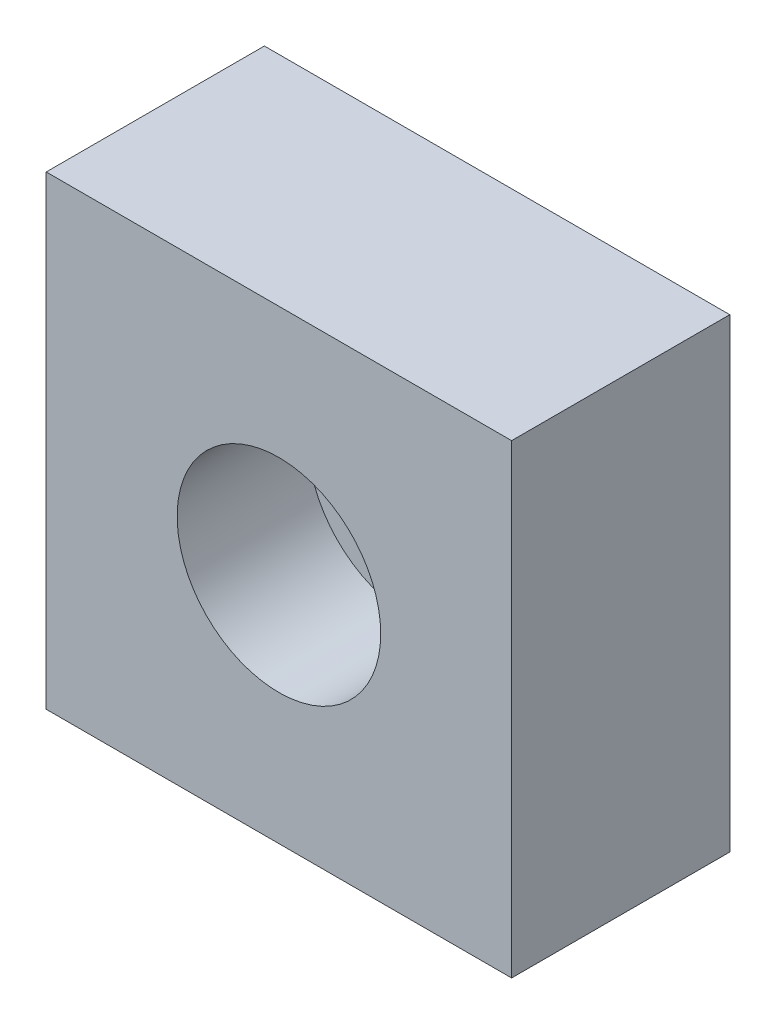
ISO-10303-21;
HEADER;
FILE_DESCRIPTION(('STEP AP214'),'2;1');
FILE_NAME('part.step','',(''),(''),'','','');
FILE_SCHEMA(('AUTOMOTIVE_DESIGN { 1 0 10303 214 1 1 1 1 }'));
ENDSEC;
DATA;
#1=APPLICATION_CONTEXT('core data for automotive mechanical design processes');
#2=APPLICATION_PROTOCOL_DEFINITION('international standard','automotive_design',2000,#1);
#3=PRODUCT_CONTEXT('',#1,'mechanical');
#4=PRODUCT('Part','Part','',(#3));
#5=PRODUCT_RELATED_PRODUCT_CATEGORY('part','',(#4));
#6=PRODUCT_DEFINITION_FORMATION('','',#4);
#7=PRODUCT_DEFINITION_CONTEXT('part definition',#1,'design');
#8=PRODUCT_DEFINITION('design','',#6,#7);
#9=PRODUCT_DEFINITION_SHAPE('','',#8);
#10=(LENGTH_UNIT() NAMED_UNIT(*) SI_UNIT(.MILLI.,.METRE.));
#11=(NAMED_UNIT(*) PLANE_ANGLE_UNIT() SI_UNIT($,.RADIAN.));
#12=(NAMED_UNIT(*) SI_UNIT($,.STERADIAN.) SOLID_ANGLE_UNIT());
#13=UNCERTAINTY_MEASURE_WITH_UNIT(LENGTH_MEASURE(1.E-05),#10,'distance_accuracy_value','');
#14=(GEOMETRIC_REPRESENTATION_CONTEXT(3) GLOBAL_UNCERTAINTY_ASSIGNED_CONTEXT((#13)) GLOBAL_UNIT_ASSIGNED_CONTEXT((#10,
#11,#12)) REPRESENTATION_CONTEXT('',''));
#15=CARTESIAN_POINT('',(0.,0.,0.));
#16=DIRECTION('',(0.,0.,1.));
#17=DIRECTION('',(1.,0.,0.));
#18=AXIS2_PLACEMENT_3D('',#15,#16,#17);
#19=CARTESIAN_POINT('',(-16.,-16.,15.));
#20=DIRECTION('',(0.,0.,-1.));
#21=DIRECTION('',(-1.,0.,0.));
#22=AXIS2_PLACEMENT_3D('',#19,#20,#21);
#23=PLANE('',#22);
#24=DIRECTION('',(0.,-1.,0.));
#25=VECTOR('',#24,1.);
#26=CARTESIAN_POINT('',(-16.,16.,15.));
#27=LINE('',#26,#25);
#28=CARTESIAN_POINT('',(-16.,16.,15.));
#29=VERTEX_POINT('',#28);
#30=CARTESIAN_POINT('',(-16.,-16.,15.));
#31=VERTEX_POINT('',#30);
#32=EDGE_CURVE('E80',#29,#31,#27,.T.);
#33=ORIENTED_EDGE('',*,*,#32,.T.);
#34=DIRECTION('',(-1.,0.,0.));
#35=VECTOR('',#34,1.);
#36=CARTESIAN_POINT('',(16.,-16.,15.));
#37=LINE('',#36,#35);
#38=CARTESIAN_POINT('',(16.,-16.,15.));
#39=VERTEX_POINT('',#38);
#40=EDGE_CURVE('E61',#39,#31,#37,.T.);
#41=ORIENTED_EDGE('',*,*,#40,.F.);
#42=DIRECTION('',(0.,1.,0.));
#43=VECTOR('',#42,1.);
#44=CARTESIAN_POINT('',(16.,-16.,15.));
#45=LINE('',#44,#43);
#46=CARTESIAN_POINT('',(16.,16.,15.));
#47=VERTEX_POINT('',#46);
#48=EDGE_CURVE('E83',#39,#47,#45,.T.);
#49=ORIENTED_EDGE('',*,*,#48,.T.);
#50=DIRECTION('',(1.,0.,0.));
#51=VECTOR('',#50,1.);
#52=CARTESIAN_POINT('',(-16.,16.,15.));
#53=LINE('',#52,#51);
#54=EDGE_CURVE('E85',#29,#47,#53,.T.);
#55=ORIENTED_EDGE('',*,*,#54,.F.);
#56=EDGE_LOOP('',(#33,#41,#49,#55));
#57=FACE_BOUND('',#56,.T.);
#58=CARTESIAN_POINT('',(0.,0.,15.));
#59=DIRECTION('',(0.,0.,1.));
#60=DIRECTION('',(1.,0.,0.));
#61=AXIS2_PLACEMENT_3D('',#58,#59,#60);
#62=CIRCLE('',#61,7.);
#63=CARTESIAN_POINT('',(7.00000000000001,0.,15.));
#64=VERTEX_POINT('',#63);
#65=EDGE_CURVE('E69',#64,#64,#62,.T.);
#66=ORIENTED_EDGE('',*,*,#65,.F.);
#67=EDGE_LOOP('',(#66));
#68=FACE_BOUND('',#67,.T.);
#69=ADVANCED_FACE('F14',(#57,#68),#23,.F.);
#70=CARTESIAN_POINT('',(-16.,-16.,0.));
#71=DIRECTION('',(0.,0.,-1.));
#72=DIRECTION('',(-1.,0.,0.));
#73=AXIS2_PLACEMENT_3D('',#70,#71,#72);
#74=PLANE('',#73);
#75=DIRECTION('',(0.,-1.,0.));
#76=VECTOR('',#75,1.);
#77=CARTESIAN_POINT('',(-16.,16.,0.));
#78=LINE('',#77,#76);
#79=CARTESIAN_POINT('',(-16.,16.,0.));
#80=VERTEX_POINT('',#79);
#81=CARTESIAN_POINT('',(-16.,-16.,0.));
#82=VERTEX_POINT('',#81);
#83=EDGE_CURVE('E65',#80,#82,#78,.T.);
#84=ORIENTED_EDGE('',*,*,#83,.F.);
#85=DIRECTION('',(1.,0.,0.));
#86=VECTOR('',#85,1.);
#87=CARTESIAN_POINT('',(-16.,16.,0.));
#88=LINE('',#87,#86);
#89=CARTESIAN_POINT('',(16.,16.,0.));
#90=VERTEX_POINT('',#89);
#91=EDGE_CURVE('E75',#80,#90,#88,.T.);
#92=ORIENTED_EDGE('',*,*,#91,.T.);
#93=DIRECTION('',(0.,1.,0.));
#94=VECTOR('',#93,1.);
#95=CARTESIAN_POINT('',(16.,-16.,0.));
#96=LINE('',#95,#94);
#97=CARTESIAN_POINT('',(16.,-16.,0.));
#98=VERTEX_POINT('',#97);
#99=EDGE_CURVE('E73',#98,#90,#96,.T.);
#100=ORIENTED_EDGE('',*,*,#99,.F.);
#101=DIRECTION('',(-1.,0.,0.));
#102=VECTOR('',#101,1.);
#103=CARTESIAN_POINT('',(16.,-16.,0.));
#104=LINE('',#103,#102);
#105=EDGE_CURVE('E58',#98,#82,#104,.T.);
#106=ORIENTED_EDGE('',*,*,#105,.T.);
#107=EDGE_LOOP('',(#84,#92,#100,#106));
#108=FACE_BOUND('',#107,.T.);
#109=CARTESIAN_POINT('',(0.,0.,0.));
#110=DIRECTION('',(0.,0.,1.));
#111=DIRECTION('',(1.,0.,0.));
#112=AXIS2_PLACEMENT_3D('',#109,#110,#111);
#113=CIRCLE('',#112,4.5);
#114=CARTESIAN_POINT('',(4.50000000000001,0.,0.));
#115=VERTEX_POINT('',#114);
#116=EDGE_CURVE('E183',#115,#115,#113,.T.);
#117=ORIENTED_EDGE('',*,*,#116,.T.);
#118=EDGE_LOOP('',(#117));
#119=FACE_BOUND('',#118,.T.);
#120=ADVANCED_FACE('F71',(#108,#119),#74,.T.);
#121=CARTESIAN_POINT('',(-16.,16.,15.));
#122=DIRECTION('',(1.,0.,0.));
#123=DIRECTION('',(0.,1.,0.));
#124=AXIS2_PLACEMENT_3D('',#121,#122,#123);
#125=PLANE('',#124);
#126=DIRECTION('',(0.,0.,-1.));
#127=VECTOR('',#126,1.);
#128=CARTESIAN_POINT('',(-16.,-16.,15.));
#129=LINE('',#128,#127);
#130=EDGE_CURVE('E9',#31,#82,#129,.T.);
#131=ORIENTED_EDGE('',*,*,#130,.F.);
#132=ORIENTED_EDGE('',*,*,#32,.F.);
#133=DIRECTION('',(0.,0.,-1.));
#134=VECTOR('',#133,1.);
#135=CARTESIAN_POINT('',(-16.,16.,15.));
#136=LINE('',#135,#134);
#137=EDGE_CURVE('E29',#29,#80,#136,.T.);
#138=ORIENTED_EDGE('',*,*,#137,.T.);
#139=ORIENTED_EDGE('',*,*,#83,.T.);
#140=EDGE_LOOP('',(#131,#132,#138,#139));
#141=FACE_BOUND('',#140,.T.);
#142=ADVANCED_FACE('F66',(#141),#125,.F.);
#143=CARTESIAN_POINT('',(16.,-16.,15.));
#144=DIRECTION('',(0.,-1.,0.));
#145=DIRECTION('',(1.,0.,0.));
#146=AXIS2_PLACEMENT_3D('',#143,#144,#145);
#147=PLANE('',#146);
#148=DIRECTION('',(0.,0.,-1.));
#149=VECTOR('',#148,1.);
#150=CARTESIAN_POINT('',(16.,-16.,15.));
#151=LINE('',#150,#149);
#152=EDGE_CURVE('E22',#39,#98,#151,.T.);
#153=ORIENTED_EDGE('',*,*,#152,.F.);
#154=ORIENTED_EDGE('',*,*,#40,.T.);
#155=ORIENTED_EDGE('',*,*,#130,.T.);
#156=ORIENTED_EDGE('',*,*,#105,.F.);
#157=EDGE_LOOP('',(#153,#154,#155,#156));
#158=FACE_BOUND('',#157,.T.);
#159=ADVANCED_FACE('F16',(#158),#147,.T.);
#160=CARTESIAN_POINT('',(16.,-16.,15.));
#161=DIRECTION('',(-1.,0.,0.));
#162=DIRECTION('',(0.,-1.,0.));
#163=AXIS2_PLACEMENT_3D('',#160,#161,#162);
#164=PLANE('',#163);
#165=DIRECTION('',(0.,0.,-1.));
#166=VECTOR('',#165,1.);
#167=CARTESIAN_POINT('',(16.,16.,15.));
#168=LINE('',#167,#166);
#169=EDGE_CURVE('E37',#47,#90,#168,.T.);
#170=ORIENTED_EDGE('',*,*,#169,.F.);
#171=ORIENTED_EDGE('',*,*,#48,.F.);
#172=ORIENTED_EDGE('',*,*,#152,.T.);
#173=ORIENTED_EDGE('',*,*,#99,.T.);
#174=EDGE_LOOP('',(#170,#171,#172,#173));
#175=FACE_BOUND('',#174,.T.);
#176=ADVANCED_FACE('F88',(#175),#164,.F.);
#177=CARTESIAN_POINT('',(-16.,16.,15.));
#178=DIRECTION('',(0.,1.,0.));
#179=DIRECTION('',(0.,0.,1.));
#180=AXIS2_PLACEMENT_3D('',#177,#178,#179);
#181=PLANE('',#180);
#182=ORIENTED_EDGE('',*,*,#54,.T.);
#183=ORIENTED_EDGE('',*,*,#169,.T.);
#184=ORIENTED_EDGE('',*,*,#91,.F.);
#185=ORIENTED_EDGE('',*,*,#137,.F.);
#186=EDGE_LOOP('',(#182,#183,#184,#185));
#187=FACE_BOUND('',#186,.T.);
#188=ADVANCED_FACE('F92',(#187),#181,.T.);
#189=CARTESIAN_POINT('',(0.,0.,15.));
#190=DIRECTION('',(0.,0.,1.));
#191=DIRECTION('',(1.,0.,0.));
#192=AXIS2_PLACEMENT_3D('',#189,#190,#191);
#193=CYLINDRICAL_SURFACE('',#192,7.);
#194=ORIENTED_EDGE('',*,*,#65,.T.);
#195=EDGE_LOOP('',(#194));
#196=FACE_BOUND('',#195,.T.);
#197=CARTESIAN_POINT('',(0.,0.,6.));
#198=DIRECTION('',(0.,0.,1.));
#199=DIRECTION('',(1.,0.,0.));
#200=AXIS2_PLACEMENT_3D('',#197,#198,#199);
#201=CIRCLE('',#200,7.);
#202=CARTESIAN_POINT('',(7.00000000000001,0.,6.));
#203=VERTEX_POINT('',#202);
#204=EDGE_CURVE('E185',#203,#203,#201,.T.);
#205=ORIENTED_EDGE('',*,*,#204,.F.);
#206=EDGE_LOOP('',(#205));
#207=FACE_BOUND('',#206,.T.);
#208=ADVANCED_FACE('F94',(#196,#207),#193,.F.);
#209=CARTESIAN_POINT('',(4.5,0.,6.));
#210=DIRECTION('',(0.,0.,1.));
#211=DIRECTION('',(1.,0.,0.));
#212=AXIS2_PLACEMENT_3D('',#209,#210,#211);
#213=PLANE('',#212);
#214=ORIENTED_EDGE('',*,*,#204,.T.);
#215=EDGE_LOOP('',(#214));
#216=FACE_BOUND('',#215,.T.);
#217=CARTESIAN_POINT('',(0.,0.,6.));
#218=DIRECTION('',(0.,0.,1.));
#219=DIRECTION('',(1.,0.,0.));
#220=AXIS2_PLACEMENT_3D('',#217,#218,#219);
#221=CIRCLE('',#220,4.5);
#222=CARTESIAN_POINT('',(4.50000000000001,0.,6.));
#223=VERTEX_POINT('',#222);
#224=EDGE_CURVE('E180',#223,#223,#221,.T.);
#225=ORIENTED_EDGE('',*,*,#224,.F.);
#226=EDGE_LOOP('',(#225));
#227=FACE_BOUND('',#226,.T.);
#228=ADVANCED_FACE('F102',(#216,#227),#213,.T.);
#229=CARTESIAN_POINT('',(0.,0.,15.));
#230=DIRECTION('',(0.,0.,1.));
#231=DIRECTION('',(1.,0.,0.));
#232=AXIS2_PLACEMENT_3D('',#229,#230,#231);
#233=CYLINDRICAL_SURFACE('',#232,4.5);
#234=ORIENTED_EDGE('',*,*,#224,.T.);
#235=EDGE_LOOP('',(#234));
#236=FACE_BOUND('',#235,.T.);
#237=ORIENTED_EDGE('',*,*,#116,.F.);
#238=EDGE_LOOP('',(#237));
#239=FACE_BOUND('',#238,.T.);
#240=ADVANCED_FACE('F164',(#236,#239),#233,.F.);
#241=CLOSED_SHELL('',(#69,#120,#142,#159,#176,#188,#208,#228,#240));
#242=MANIFOLD_SOLID_BREP('B1',#241);
#243=ADVANCED_BREP_SHAPE_REPRESENTATION('',(#18,#242),#14);
#244=SHAPE_DEFINITION_REPRESENTATION(#9,#243);
ENDSEC;
END-ISO-10303-21;
